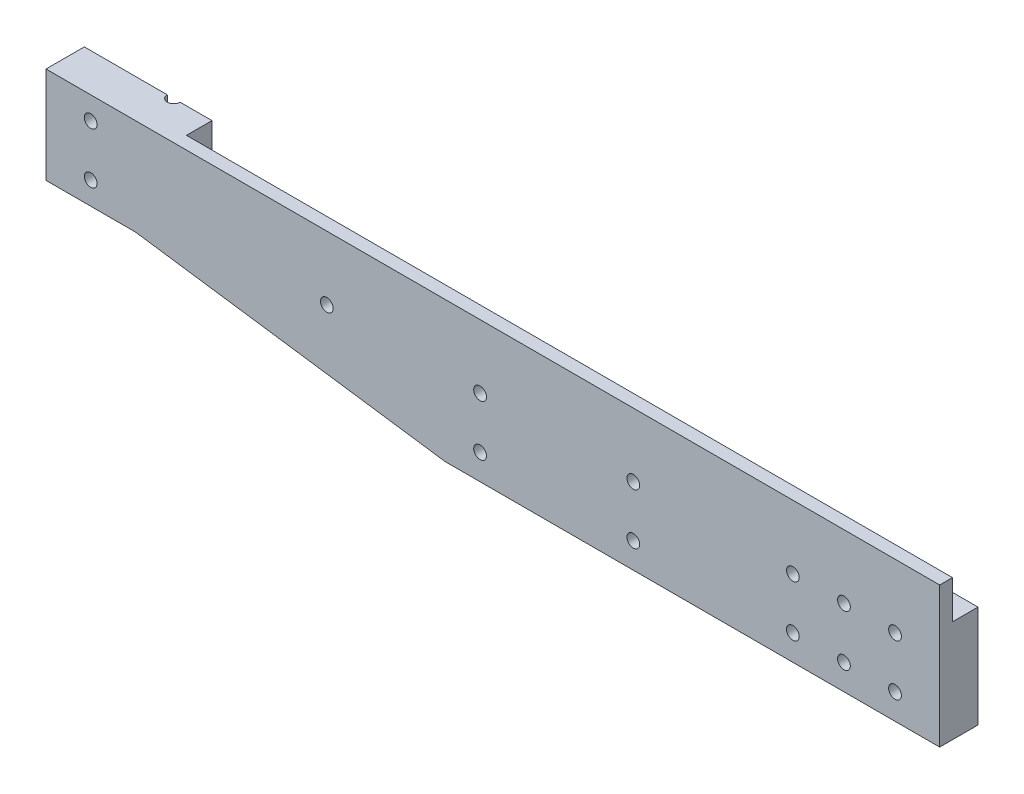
from build123d import *

# Parameters (mm, degrees)
SKETCH1_W               = 85.725
SKETCH1_H               = 2.54
BOSS_EXTRUDE1_DEPTH     = 69.85
CUT_EXTRUDE1_DEPTH      = 498.422296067
CUT_EXTRUDE1_DEPTH_BACK = 498.422296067
SKETCH3_W               = 12.7
SKETCH3_H               = 19.05
CUT_EXTRUDE2_DEPTH      = 381
CUT_EXTRUDE3_DEPTH      = 498.422296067
CUT_EXTRUDE3_DEPTH_BACK = 498.422296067
SKETCH5_W               = 19.05
SKETCH5_H               = 47.993709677
BOSS_EXTRUDE2_DEPTH     = 44.45
CUT_EXTRUDE5_REACH      = 452.358
SKETCH8_R               = 3.175
CUT_EXTRUDE6_REACH      = 452.358
SKETCH9_R               = 3.175
SKETCH9_R_2             = 3.1496
CUT_EXTRUDE7_REACH      = 452.358
SKETCH11_R              = 3.175


with BuildPart() as part:
    # Sketch1 → Boss-Extrude1 (new body)
    with BuildSketch(Plane(origin=(0, 0, 0), x_dir=(1, 0, 0), z_dir=(0, 1, 0))):
        with Locations((-68.2625, 1.27)):
            Rectangle(SKETCH1_W, SKETCH1_H)
        Polygon((-111.125, 2.54), (-25.4, 2.54), (-25.4, 0), (0, 0), (0, 19.05), (-25.4, 19.05), (-492.125, 19.05), (-492.125, 0), (-111.125, 0), align=None)
    extrude(amount=BOSS_EXTRUDE1_DEPTH)

    # Sketch2 → Cut-Extrude1 (cut, two sides: drawn at the far end of the back side and taken through both)
    with BuildSketch(Plane.XY.offset(-CUT_EXTRUDE1_DEPTH_BACK)):
        Polygon((-1478.95977109, 174.991870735), (-492.125, 34.925), (-246.0625, 0), (740.77227109, -140.066870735), (460.638529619, -2113.736412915), (-1759.09351256, -1798.677671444), align=None)
    extrude(amount=CUT_EXTRUDE1_DEPTH + CUT_EXTRUDE1_DEPTH_BACK, mode=Mode.SUBTRACT)

    # Sketch3 → Cut-Extrude2 (cut)
    with BuildSketch(Plane(origin=(0, 0, 0), x_dir=(0, 0, -1), z_dir=(1, 0, 0))):
        with Locations((12.7, 60.325)):
            Rectangle(SKETCH3_W, SKETCH3_H)
    extrude(amount=-CUT_EXTRUDE2_DEPTH, mode=Mode.SUBTRACT)

    # Sketch4 → Cut-Extrude3 (cut, two sides: drawn at the far end of the back side and taken through both)
    with BuildSketch(Plane(origin=(0, 69.85, 0), x_dir=(-1, 0, 0), z_dir=(0, 1, 0)).offset(-CUT_EXTRUDE3_DEPTH_BACK)):
        Polygon((400.05, 811.006629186), (400.05, 0), (400.05, -19.05), (400.05, -830.056629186), (2022.063258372, -830.056629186), (2022.063258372, 811.006629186), align=None)
    extrude(amount=CUT_EXTRUDE3_DEPTH + CUT_EXTRUDE3_DEPTH_BACK, mode=Mode.SUBTRACT)

    # Sketch5 → Boss-Extrude2 (add)
    with BuildSketch(Plane.ZY.offset(400.05)):
        with Locations((-9.525, 45.853145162)):
            Rectangle(SKETCH5_W, SKETCH5_H)
    extrude(amount=BOSS_EXTRUDE2_DEPTH)

    # Sketch8 → Cut-Extrude5 (cut, up to next)
    with BuildSketch(Plane(origin=(0, 69.85, 0), x_dir=(1, 0, 0), z_dir=(0, 1, 0)), mode=Mode.PRIVATE) as cut_extrude5_sk1:
        with Locations((-400.05, 19.05)):
            Circle(SKETCH8_R)
    cut_extrude5_tool1 = extrude(cut_extrude5_sk1.sketch, amount=-CUT_EXTRUDE5_REACH, mode=Mode.PRIVATE) & part.part
    add(cut_extrude5_tool1.solids().sort_by_distance((-400.05, 69.85, -19.05))[0], mode=Mode.SUBTRACT)

    # Sketch9 → Cut-Extrude6 (cut, up to next)
    with BuildSketch(Plane.XY, mode=Mode.PRIVATE) as cut_extrude6_sk1:
        with Locations((-22.225, 38.1)):
            Circle(SKETCH9_R)
    cut_extrude6_tool1 = extrude(cut_extrude6_sk1.sketch, amount=-CUT_EXTRUDE6_REACH, mode=Mode.PRIVATE) & part.part
    # Sketch9 → Cut-Extrude6 (cut, up to next)
    with BuildSketch(Plane.XY, mode=Mode.PRIVATE) as cut_extrude6_sk2:
        with Locations((-22.225, 12.7)):
            Circle(SKETCH9_R)
    cut_extrude6_tool2 = extrude(cut_extrude6_sk2.sketch, amount=-CUT_EXTRUDE6_REACH, mode=Mode.PRIVATE) & part.part
    # Sketch9 → Cut-Extrude6 (cut, up to next)
    with BuildSketch(Plane.XY, mode=Mode.PRIVATE) as cut_extrude6_sk3:
        with Locations((-152.4, 12.7)):
            Circle(SKETCH9_R)
    cut_extrude6_tool3 = extrude(cut_extrude6_sk3.sketch, amount=-CUT_EXTRUDE6_REACH, mode=Mode.PRIVATE) & part.part
    # Sketch9 → Cut-Extrude6 (cut, up to next)
    with BuildSketch(Plane.XY, mode=Mode.PRIVATE) as cut_extrude6_sk4:
        with Locations((-228.6, 12.7)):
            Circle(SKETCH9_R)
    cut_extrude6_tool4 = extrude(cut_extrude6_sk4.sketch, amount=-CUT_EXTRUDE6_REACH, mode=Mode.PRIVATE) & part.part
    # Sketch9 → Cut-Extrude6 (cut, up to next)
    with BuildSketch(Plane.XY, mode=Mode.PRIVATE) as cut_extrude6_sk5:
        with Locations((-304.8, 38.1)):
            Circle(SKETCH9_R)
    cut_extrude6_tool5 = extrude(cut_extrude6_sk5.sketch, amount=-CUT_EXTRUDE6_REACH, mode=Mode.PRIVATE) & part.part
    # Sketch9 → Cut-Extrude6 (cut, up to next)
    with BuildSketch(Plane.XY, mode=Mode.PRIVATE) as cut_extrude6_sk6:
        with Locations((-228.6, 38.1)):
            Circle(SKETCH9_R)
    cut_extrude6_tool6 = extrude(cut_extrude6_sk6.sketch, amount=-CUT_EXTRUDE6_REACH, mode=Mode.PRIVATE) & part.part
    # Sketch9 → Cut-Extrude6 (cut, up to next)
    with BuildSketch(Plane.XY, mode=Mode.PRIVATE) as cut_extrude6_sk7:
        with Locations((-152.4, 38.1)):
            Circle(SKETCH9_R)
    cut_extrude6_tool7 = extrude(cut_extrude6_sk7.sketch, amount=-CUT_EXTRUDE6_REACH, mode=Mode.PRIVATE) & part.part
    # Sketch9 → Cut-Extrude6 (cut, up to next)
    with BuildSketch(Plane.XY, mode=Mode.PRIVATE) as cut_extrude6_sk8:
        with Locations((-73.025, 12.7)):
            Circle(SKETCH9_R)
    cut_extrude6_tool8 = extrude(cut_extrude6_sk8.sketch, amount=-CUT_EXTRUDE6_REACH, mode=Mode.PRIVATE) & part.part
    # Sketch9 → Cut-Extrude6 (cut, up to next)
    with BuildSketch(Plane.XY, mode=Mode.PRIVATE) as cut_extrude6_sk9:
        with Locations((-73.025, 38.1)):
            Circle(SKETCH9_R_2)
    cut_extrude6_tool9 = extrude(cut_extrude6_sk9.sketch, amount=-CUT_EXTRUDE6_REACH, mode=Mode.PRIVATE) & part.part
    # Sketch9 → Cut-Extrude6 (cut, up to next)
    with BuildSketch(Plane.XY, mode=Mode.PRIVATE) as cut_extrude6_sk10:
        with Locations((-47.625, 38.1)):
            Circle(SKETCH9_R)
    cut_extrude6_tool10 = extrude(cut_extrude6_sk10.sketch, amount=-CUT_EXTRUDE6_REACH, mode=Mode.PRIVATE) & part.part
    # Sketch9 → Cut-Extrude6 (cut, up to next)
    with BuildSketch(Plane.XY, mode=Mode.PRIVATE) as cut_extrude6_sk11:
        with Locations((-47.625, 12.7)):
            Circle(SKETCH9_R)
    cut_extrude6_tool11 = extrude(cut_extrude6_sk11.sketch, amount=-CUT_EXTRUDE6_REACH, mode=Mode.PRIVATE) & part.part
    add(cut_extrude6_tool1.solids().sort_by_distance((-22.225, 38.1, 0))[0], mode=Mode.SUBTRACT)
    add(cut_extrude6_tool2.solids().sort_by_distance((-22.225, 12.7, 0))[0], mode=Mode.SUBTRACT)
    add(cut_extrude6_tool3.solids().sort_by_distance((-152.4, 12.7, 0))[0], mode=Mode.SUBTRACT)
    add(cut_extrude6_tool4.solids().sort_by_distance((-228.6, 12.7, 0))[0], mode=Mode.SUBTRACT)
    add(cut_extrude6_tool5.solids().sort_by_distance((-304.8, 38.1, 0))[0], mode=Mode.SUBTRACT)
    add(cut_extrude6_tool6.solids().sort_by_distance((-228.6, 38.1, 0))[0], mode=Mode.SUBTRACT)
    add(cut_extrude6_tool7.solids().sort_by_distance((-152.4, 38.1, 0))[0], mode=Mode.SUBTRACT)
    add(cut_extrude6_tool8.solids().sort_by_distance((-73.025, 12.7, 0))[0], mode=Mode.SUBTRACT)
    add(cut_extrude6_tool9.solids().sort_by_distance((-73.025, 38.1, 0))[0], mode=Mode.SUBTRACT)
    add(cut_extrude6_tool10.solids().sort_by_distance((-47.625, 38.1, 0))[0], mode=Mode.SUBTRACT)
    add(cut_extrude6_tool11.solids().sort_by_distance((-47.625, 12.7, 0))[0], mode=Mode.SUBTRACT)

    # Sketch11 → Cut-Extrude7 (cut, up to next)
    with BuildSketch(Plane.XY, mode=Mode.PRIVATE) as cut_extrude7_sk1:
        with Locations((-422.275, 58.553145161)):
            Circle(SKETCH11_R)
    cut_extrude7_tool1 = extrude(cut_extrude7_sk1.sketch, amount=-CUT_EXTRUDE7_REACH, mode=Mode.PRIVATE) & part.part
    # Sketch11 → Cut-Extrude7 (cut, up to next)
    with BuildSketch(Plane.XY, mode=Mode.PRIVATE) as cut_extrude7_sk2:
        with Locations((-422.275, 33.153145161)):
            Circle(SKETCH11_R)
    cut_extrude7_tool2 = extrude(cut_extrude7_sk2.sketch, amount=-CUT_EXTRUDE7_REACH, mode=Mode.PRIVATE) & part.part
    add(cut_extrude7_tool1.solids().sort_by_distance((-422.275, 58.553145, 0))[0], mode=Mode.SUBTRACT)
    add(cut_extrude7_tool2.solids().sort_by_distance((-422.275, 33.153145, 0))[0], mode=Mode.SUBTRACT)


solid = part.part
